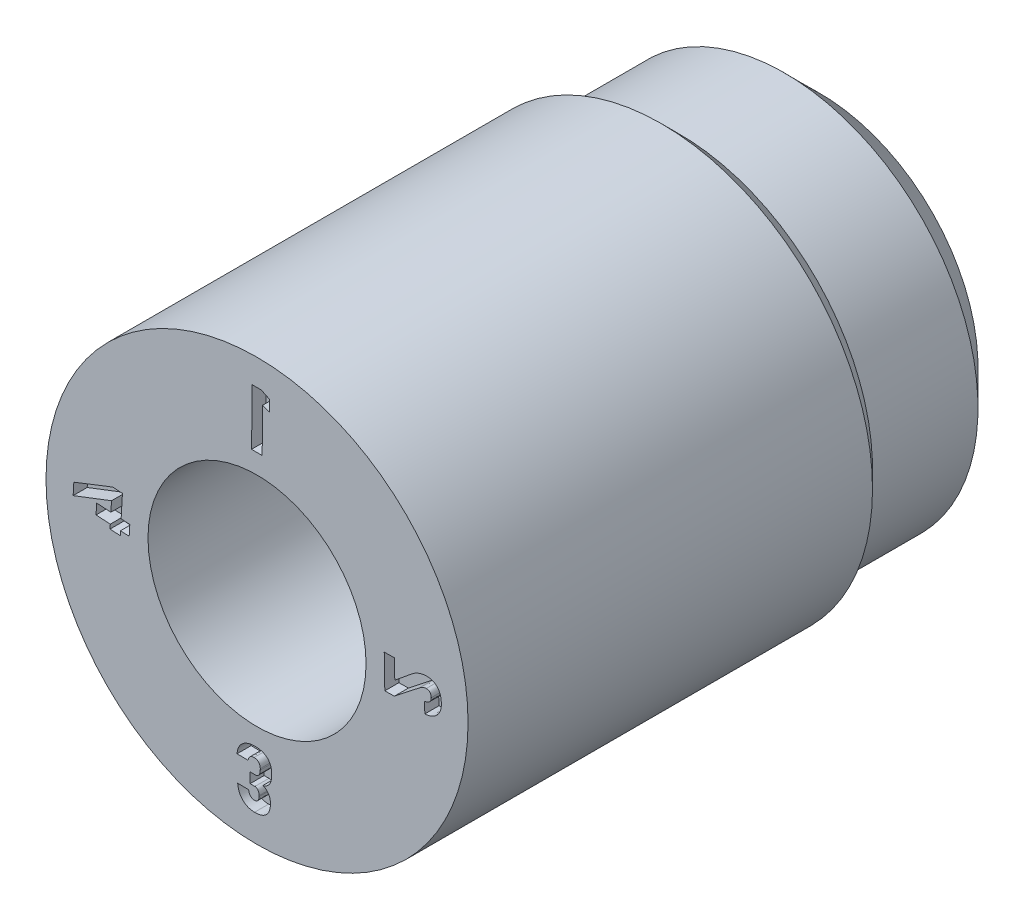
from build123d import *

# Parameters (mm, degrees)
CUT_EXTRUDE1_DEPTH = 0.2


with BuildPart() as part:
    # Sketch2 → Revolve1 (revolve)
    with BuildSketch(Plane(origin=(0, 0, 0), x_dir=(1, 0, 0), z_dir=(0, 1, 0)), mode=Mode.PRIVATE) as revolve1_sk:
        Polygon((2.249621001, 7.999984), (0.8, 7.999984), (0.8, 5.499984), (1.55, 5.499984), (1.55, 0), (3, 0), (3, 5.749984), (2.75, 5.999984), (2.75, 7.499605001), align=None)
    revolve(revolve1_sk.sketch.rotate(Axis((0, 0, -4.849143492), (0, 0, 1)), 180), axis=Axis((0, 0, -4.849143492), (0, 0, 1)))

    # Sketch7 → Cut-Extrude1 (cut)
    with BuildSketch(Plane.XY):
        Polygon((-0.077754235, 1.827409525), (0.072887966, 1.825638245), (0.080129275, 2.44858811), (0.177072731, 2.410416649), (0.178908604, 2.570678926), (0.060025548, 2.6258405), (-0.068605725, 2.62741702), align=None)
        with BuildLine():
            Line((1.952454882, -0.197374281), (2.308813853, 0.083295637))
            add(Edge.make_bspline(
                [(2.308813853, 0.083295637), (2.323782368, 0.095284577), (2.344129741, 0.108058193), (2.370224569, 0.117787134), (2.38592766, 0.1222879), (2.397751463, 0.123728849), (2.405447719, 0.123993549)],
                knots=[0, 0, 0, 0, 0.540916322, 0.666678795, 0.783169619, 1, 1, 1, 1], degree=3))
            Line((2.405447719, 0.123993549), (2.406588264, 0.124032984))
            add(Edge.make_bspline(
                [(2.406588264, 0.124032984), (2.416376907, 0.124254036), (2.430812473, 0.122161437), (2.447449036, 0.113340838), (2.457419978, 0.104071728), (2.465331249, 0.092387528), (2.473659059, 0.072895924), (2.475141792, 0.056213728), (2.475556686, 0.044852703)],
                knots=[0, 0, 0, 0, 0.24720834, 0.358279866, 0.469621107, 0.586602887, 0.711445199, 1, 1, 1, 1], degree=3))
            add(Edge.make_bspline(
                [(2.475556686, 0.044852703), (2.475807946, 0.033382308), (2.473511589, 0.016157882), (2.462972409, -0.00379538), (2.452259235, -0.016549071), (2.4388094, -0.027381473), (2.416083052, -0.039066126), (2.396726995, -0.043858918), (2.38308509, -0.045455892)],
                knots=[0, 0, 0, 0, 0.241138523, 0.353700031, 0.468068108, 0.587475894, 0.712595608, 1, 1, 1, 1], degree=3))
            Line((2.38308509, -0.045455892), (2.385004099, -0.200036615))
            add(Edge.make_bspline(
                [(2.385004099, -0.200036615), (2.40914042, -0.198225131), (2.443266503, -0.192142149), (2.485704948, -0.177019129), (2.513740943, -0.16237143), (2.538910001, -0.144970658), (2.561143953, -0.124964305), (2.579754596, -0.101891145), (2.595308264, -0.076516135), (2.607207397, -0.048648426), (2.618788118, -0.007942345), (2.62129527, 0.024424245), (2.620855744, 0.046287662)],
                knots=[0, 0, 0, 0, 0.185636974, 0.271683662, 0.354290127, 0.43428246, 0.512411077, 0.589241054, 0.667203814, 0.746365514, 0.827400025, 1, 1, 1, 1], degree=3))
            add(Edge.make_bspline(
                [(2.620855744, 0.046287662), (2.620229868, 0.069470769), (2.61743148, 0.103359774), (2.606110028, 0.145708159), (2.594914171, 0.17358581), (2.580747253, 0.19842918), (2.564012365, 0.22037339), (2.544091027, 0.238766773), (2.521751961, 0.254220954), (2.496639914, 0.265859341), (2.45902579, 0.277226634), (2.428787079, 0.279545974), (2.408236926, 0.279226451)],
                knots=[0, 0, 0, 0, 0.194630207, 0.282982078, 0.366380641, 0.445603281, 0.521924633, 0.59661522, 0.671832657, 0.7485995, 0.827500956, 1, 1, 1, 1], degree=3))
            add(Edge.make_bspline(
                [(2.408236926, 0.279226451), (2.389423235, 0.278962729), (2.362081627, 0.276113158), (2.326325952, 0.267401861), (2.299687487, 0.258678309), (2.273771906, 0.247958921), (2.240964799, 0.230796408), (2.218051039, 0.215297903), (2.203838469, 0.203644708)],
                knots=[0, 0, 0, 0, 0.246243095, 0.37111884, 0.498466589, 0.626038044, 0.750970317, 1, 1, 1, 1], degree=3))
            Line((2.203838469, 0.203644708), (1.958431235, 0.002503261))
            Line((1.958431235, 0.002503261), (1.953708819, 0.275908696))
            Line((1.953708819, 0.275908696), (1.808449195, 0.273333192))
            Line((1.808449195, 0.273333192), (1.816488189, -0.199791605))
            Line((1.816488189, -0.199791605), (1.952454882, -0.197374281))
        make_face()
        with BuildLine():
            Line((-0.28350305, -2.024214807), (-0.12781217, -2.026404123))
            add(Edge.make_bspline(
                [(-0.12781217, -2.026404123), (-0.126488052, -2.018684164), (-0.124072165, -2.007361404), (-0.11810242, -1.993591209), (-0.11279194, -1.984551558), (-0.106635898, -1.976428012), (-0.099716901, -1.969294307), (-0.091834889, -1.963377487), (-0.083369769, -1.958341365), (-0.074154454, -1.954275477), (-0.060511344, -1.950749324), (-0.049837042, -1.94948362), (-0.042515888, -1.949815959)],
                knots=[0, 0, 0, 0, 0.18612936, 0.272233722, 0.354676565, 0.43403317, 0.513316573, 0.589352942, 0.666901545, 0.746425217, 0.82710867, 1, 1, 1, 1], degree=3))
            add(Edge.make_bspline(
                [(-0.042515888, -1.949815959), (-0.029691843, -1.950115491), (-0.010824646, -1.95254928), (0.01104014, -1.963405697), (0.023968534, -1.974420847), (0.034341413, -1.987896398), (0.043931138, -2.010474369), (0.046386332, -2.029368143), (0.045953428, -2.042428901)],
                knots=[0, 0, 0, 0, 0.265854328, 0.38362786, 0.498411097, 0.613194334, 0.730967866, 1, 1, 1, 1], degree=3))
            Line((0.045953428, -2.042428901), (0.045799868, -2.061179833))
            add(Edge.make_bspline(
                [(0.045799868, -2.061179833), (0.045490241, -2.074712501), (0.043622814, -2.094250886), (0.035149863, -2.11761025), (0.026537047, -2.131427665), (0.015704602, -2.142345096), (-0.002200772, -2.152972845), (-0.018050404, -2.155544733), (-0.028692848, -2.155331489)],
                knots=[0, 0, 0, 0, 0.299739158, 0.427976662, 0.545251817, 0.656409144, 0.764247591, 1, 1, 1, 1], degree=3))
            Line((-0.028692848, -2.155331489), (-0.096350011, -2.154415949))
            Line((-0.096350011, -2.154415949), (-0.098435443, -2.299671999))
            Line((-0.098435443, -2.299671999), (-0.03077828, -2.300587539))
            add(Edge.make_bspline(
                [(-0.03077828, -2.300587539), (-0.022023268, -2.300413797), (-0.009121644, -2.303433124), (0.005282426, -2.313095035), (0.013897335, -2.323060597), (0.020605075, -2.335314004), (0.02708559, -2.355616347), (0.028608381, -2.372328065), (0.028245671, -2.383966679)],
                knots=[0, 0, 0, 0, 0.227254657, 0.334902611, 0.44713919, 0.567132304, 0.696605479, 1, 1, 1, 1], degree=3))
            Line((0.028245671, -2.383966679), (0.028054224, -2.39782407))
            add(Edge.make_bspline(
                [(0.028054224, -2.39782407), (0.027889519, -2.408798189), (0.025828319, -2.424621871), (0.018233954, -2.443527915), (0.010274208, -2.454648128), (0.000433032, -2.463430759), (-0.015714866, -2.471925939), (-0.02969531, -2.473898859), (-0.039122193, -2.473734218)],
                knots=[0, 0, 0, 0, 0.286763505, 0.411667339, 0.528163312, 0.640613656, 0.753081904, 1, 1, 1, 1], degree=3))
            add(Edge.make_bspline(
                [(-0.039122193, -2.473734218), (-0.045664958, -2.473574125), (-0.055550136, -2.472529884), (-0.067618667, -2.467584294), (-0.076232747, -2.463011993), (-0.084212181, -2.457036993), (-0.091651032, -2.449941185), (-0.098193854, -2.441553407), (-0.104273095, -2.432167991), (-0.109453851, -2.421615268), (-0.115598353, -2.405793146), (-0.11821126, -2.392972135), (-0.119843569, -2.384255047)],
                knots=[0, 0, 0, 0, 0.150011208, 0.222512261, 0.296199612, 0.371809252, 0.448975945, 0.529871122, 0.613710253, 0.703489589, 0.797355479, 1, 1, 1, 1], degree=3))
            Line((-0.119843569, -2.384255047), (-0.275045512, -2.382078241))
            add(Edge.make_bspline(
                [(-0.275045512, -2.382078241), (-0.273440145, -2.405220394), (-0.26736797, -2.438869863), (-0.252666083, -2.480994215), (-0.238022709, -2.509016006), (-0.220782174, -2.534279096), (-0.200928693, -2.556713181), (-0.178272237, -2.575732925), (-0.153256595, -2.591680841), (-0.126126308, -2.604008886), (-0.087221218, -2.616400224), (-0.056372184, -2.620091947), (-0.035532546, -2.620277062)],
                knots=[0, 0, 0, 0, 0.18550985, 0.272282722, 0.356205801, 0.437835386, 0.516628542, 0.595241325, 0.673882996, 0.753403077, 0.833124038, 1, 1, 1, 1], degree=3))
            add(Edge.make_bspline(
                [(-0.035532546, -2.620277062), (-0.018771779, -2.62066356), (0.005687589, -2.619167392), (0.037117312, -2.614088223), (0.0585821, -2.608450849), (0.078497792, -2.600926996), (0.097080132, -2.591957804), (0.114031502, -2.581026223), (0.129633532, -2.56859691), (0.143339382, -2.554280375), (0.155578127, -2.538787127), (0.165964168, -2.521724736), (0.174073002, -2.503088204), (0.180988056, -2.483195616), (0.187314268, -2.453854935), (0.189343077, -2.430869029), (0.189554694, -2.415165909)],
                knots=[0, 0, 0, 0, 0.145068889, 0.211710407, 0.275453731, 0.336893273, 0.395835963, 0.453793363, 0.511222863, 0.568177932, 0.625031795, 0.681947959, 0.7405968, 0.800735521, 0.86405349, 1, 1, 1, 1], degree=3))
            Line((0.189554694, -2.415165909), (0.189845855, -2.391036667))
            add(Edge.make_bspline(
                [(0.189845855, -2.391036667), (0.190082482, -2.373536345), (0.187214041, -2.347594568), (0.175769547, -2.31537986), (0.163703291, -2.293583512), (0.148208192, -2.274068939), (0.123382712, -2.250445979), (0.100290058, -2.237926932), (0.084180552, -2.231118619)],
                knots=[0, 0, 0, 0, 0.256895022, 0.37829327, 0.499432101, 0.620591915, 0.742541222, 1, 1, 1, 1], degree=3))
            add(Edge.make_bspline(
                [(0.084180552, -2.231118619), (0.093516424, -2.229138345), (0.107011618, -2.224850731), (0.124048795, -2.217264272), (0.135742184, -2.210231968), (0.146706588, -2.202276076), (0.156756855, -2.193068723), (0.16624298, -2.183086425), (0.174671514, -2.171828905), (0.182046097, -2.159586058), (0.188918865, -2.146686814), (0.194356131, -2.13277209), (0.199025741, -2.118136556), (0.202656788, -2.102687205), (0.206317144, -2.080507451), (0.20746423, -2.06331958), (0.207662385, -2.051621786)],
                knots=[0, 0, 0, 0, 0.120545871, 0.178653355, 0.235490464, 0.292828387, 0.349719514, 0.407664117, 0.466799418, 0.527168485, 0.588350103, 0.651429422, 0.715828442, 0.782566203, 0.851980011, 1, 1, 1, 1], degree=3))
            Line((0.207662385, -2.051621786), (0.207953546, -2.027492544))
            add(Edge.make_bspline(
                [(0.207953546, -2.027492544), (0.208373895, -2.005726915), (0.205609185, -1.973914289), (0.194747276, -1.933992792), (0.182890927, -1.907664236), (0.167672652, -1.884073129), (0.149399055, -1.863048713), (0.127387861, -1.845524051), (0.10266118, -1.830553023), (0.07483746, -1.818787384), (0.032714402, -1.806981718), (-0.001042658, -1.804007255), (-0.024099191, -1.803673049)],
                knots=[0, 0, 0, 0, 0.178128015, 0.259598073, 0.337592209, 0.413473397, 0.488705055, 0.564513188, 0.642808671, 0.724671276, 0.810985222, 1, 1, 1, 1], degree=3))
            add(Edge.make_bspline(
                [(-0.024099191, -1.803673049), (-0.047030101, -1.803627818), (-0.08107155, -1.805561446), (-0.124110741, -1.816611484), (-0.153729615, -1.827699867), (-0.180999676, -1.841978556), (-0.205478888, -1.85955408), (-0.22690235, -1.880370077), (-0.245612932, -1.903894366), (-0.260747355, -1.930435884), (-0.276951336, -1.969902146), (-0.281822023, -2.002319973), (-0.28350305, -2.024214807)],
                knots=[0, 0, 0, 0, 0.181185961, 0.266640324, 0.349465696, 0.430032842, 0.508612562, 0.586172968, 0.664836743, 0.744782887, 0.826270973, 1, 1, 1, 1], degree=3))
        make_face()
        Polygon((-2.052070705, 0.375068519), (-2.604331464, 0.159464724), (-2.614231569, -0.011223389), (-2.068930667, 0.198128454), (-2.077335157, 0.052432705), (-2.279734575, 0.064141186), (-2.288482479, -0.086657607), (-2.08603418, -0.098368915), (-2.089658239, -0.161193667), (-1.944384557, -0.169466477), (-1.940774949, -0.106771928), (-1.817492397, -0.113903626), (-1.808744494, 0.036895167), (-1.932092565, 0.044030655), (-1.913493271, 0.367078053), align=None)
    extrude(amount=-CUT_EXTRUDE1_DEPTH, mode=Mode.SUBTRACT)


solid = part.part
